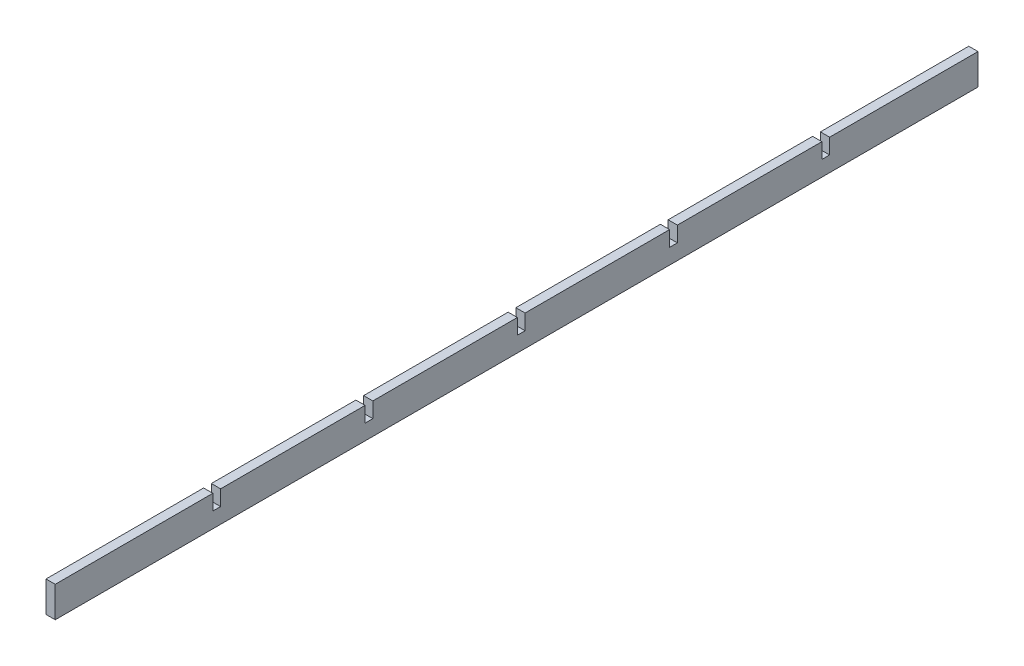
from build123d import *

# Parameters (mm, degrees)
CROQUIS1_W              = 300
CROQUIS1_H              = 10
SALIENTE_EXTRUIR1_DEPTH = 3
CROQUIS2_W              = 2.52
CROQUIS2_H              = 5
CORTAR_EXTRUIR1_DEPTH   = 10


with BuildPart() as part:
    # Croquis1 → Saliente-Extruir1 (new body)
    with BuildSketch(Plane(origin=(0, 0, 0), x_dir=(0, 0, -1), z_dir=(1, 0, 0))):
        with Locations((1.5, 0)):
            Rectangle(CROQUIS1_W, CROQUIS1_H)
    extrude(amount=SALIENTE_EXTRUIR1_DEPTH)

    # Croquis2 → Cortar-Extruir1 (cut)
    with BuildSketch(Plane(origin=(3, 0, 0), x_dir=(0, 0, -1), z_dir=(1, 0, 0))):
        with Locations((102, 2.5)):
            Rectangle(CROQUIS2_W, CROQUIS2_H)
        with Locations((52.5, 2.5)):
            Rectangle(CROQUIS2_W, CROQUIS2_H)
        with Locations((3, 2.5)):
            Rectangle(CROQUIS2_W, CROQUIS2_H)
        with Locations((-46.5, 2.5)):
            Rectangle(CROQUIS2_W, CROQUIS2_H)
        with Locations((-96, 2.5)):
            Rectangle(CROQUIS2_W, CROQUIS2_H)
    extrude(amount=-CORTAR_EXTRUIR1_DEPTH, mode=Mode.SUBTRACT)


solid = part.part
